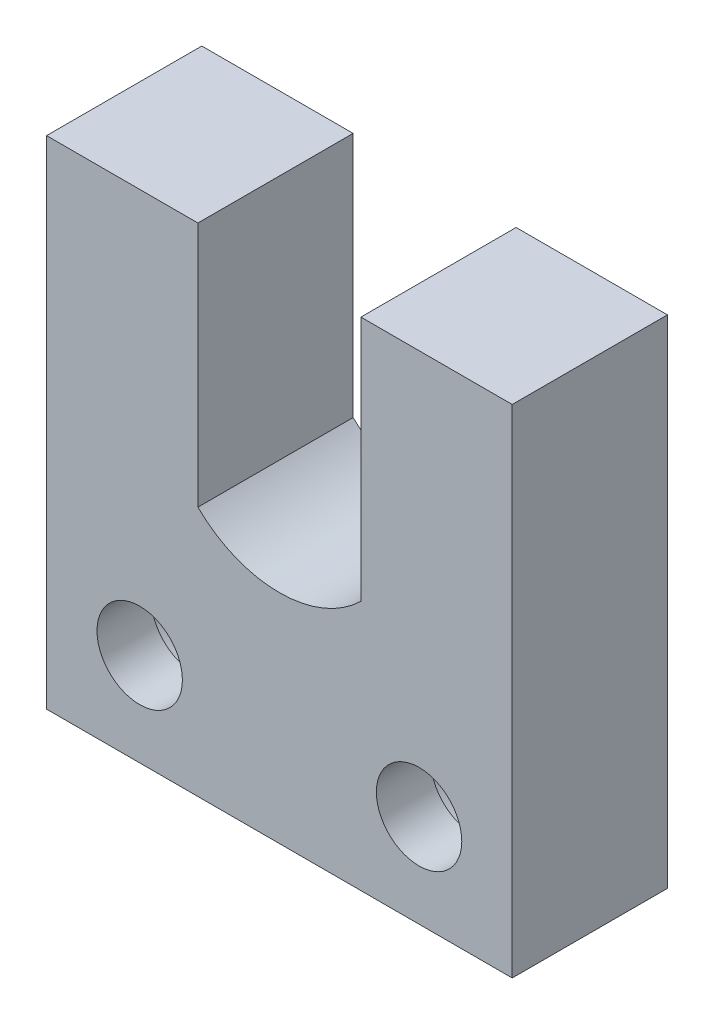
ISO-10303-21;
HEADER;
FILE_DESCRIPTION(('STEP AP214'),'2;1');
FILE_NAME('part.step','',(''),(''),'','','');
FILE_SCHEMA(('AUTOMOTIVE_DESIGN { 1 0 10303 214 1 1 1 1 }'));
ENDSEC;
DATA;
#1=APPLICATION_CONTEXT('core data for automotive mechanical design processes');
#2=APPLICATION_PROTOCOL_DEFINITION('international standard','automotive_design',2000,#1);
#3=PRODUCT_CONTEXT('',#1,'mechanical');
#4=PRODUCT('Part','Part','',(#3));
#5=PRODUCT_RELATED_PRODUCT_CATEGORY('part','',(#4));
#6=PRODUCT_DEFINITION_FORMATION('','',#4);
#7=PRODUCT_DEFINITION_CONTEXT('part definition',#1,'design');
#8=PRODUCT_DEFINITION('design','',#6,#7);
#9=PRODUCT_DEFINITION_SHAPE('','',#8);
#10=(LENGTH_UNIT() NAMED_UNIT(*) SI_UNIT(.MILLI.,.METRE.));
#11=(NAMED_UNIT(*) PLANE_ANGLE_UNIT() SI_UNIT($,.RADIAN.));
#12=(NAMED_UNIT(*) SI_UNIT($,.STERADIAN.) SOLID_ANGLE_UNIT());
#13=UNCERTAINTY_MEASURE_WITH_UNIT(LENGTH_MEASURE(1.E-05),#10,'distance_accuracy_value','');
#14=(GEOMETRIC_REPRESENTATION_CONTEXT(3) GLOBAL_UNCERTAINTY_ASSIGNED_CONTEXT((#13)) GLOBAL_UNIT_ASSIGNED_CONTEXT((#10,
#11,#12)) REPRESENTATION_CONTEXT('',''));
#15=CARTESIAN_POINT('',(0.,0.,0.));
#16=DIRECTION('',(0.,0.,1.));
#17=DIRECTION('',(1.,0.,0.));
#18=AXIS2_PLACEMENT_3D('',#15,#16,#17);
#19=CARTESIAN_POINT('',(6.,6.00000000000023,10.));
#20=DIRECTION('',(0.,0.,-1.));
#21=DIRECTION('',(-1.,0.,0.));
#22=AXIS2_PLACEMENT_3D('',#19,#20,#21);
#23=CYLINDRICAL_SURFACE('',#22,2.75);
#24=CARTESIAN_POINT('',(6.,6.00000000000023,10.));
#25=DIRECTION('',(0.,0.,1.));
#26=DIRECTION('',(1.,0.,0.));
#27=AXIS2_PLACEMENT_3D('',#24,#25,#26);
#28=CIRCLE('',#27,2.75);
#29=CARTESIAN_POINT('',(8.75,6.00000000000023,10.));
#30=VERTEX_POINT('',#29);
#31=EDGE_CURVE('E160',#30,#30,#28,.T.);
#32=ORIENTED_EDGE('',*,*,#31,.T.);
#33=EDGE_LOOP('',(#32));
#34=FACE_BOUND('',#33,.T.);
#35=CARTESIAN_POINT('',(6.,6.00000000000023,6.5));
#36=DIRECTION('',(0.,0.,-1.));
#37=DIRECTION('',(-1.,0.,0.));
#38=AXIS2_PLACEMENT_3D('',#35,#36,#37);
#39=CIRCLE('',#38,2.75);
#40=CARTESIAN_POINT('',(3.25,6.00000000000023,6.5));
#41=VERTEX_POINT('',#40);
#42=EDGE_CURVE('E36',#41,#41,#39,.T.);
#43=ORIENTED_EDGE('',*,*,#42,.T.);
#44=EDGE_LOOP('',(#43));
#45=FACE_BOUND('',#44,.T.);
#46=ADVANCED_FACE('F32',(#34,#45),#23,.F.);
#47=CARTESIAN_POINT('',(24.,6.00000000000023,10.));
#48=DIRECTION('',(0.,0.,-1.));
#49=DIRECTION('',(-1.,0.,0.));
#50=AXIS2_PLACEMENT_3D('',#47,#48,#49);
#51=CYLINDRICAL_SURFACE('',#50,2.75);
#52=CARTESIAN_POINT('',(24.,6.00000000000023,10.));
#53=DIRECTION('',(0.,0.,1.));
#54=DIRECTION('',(1.,0.,0.));
#55=AXIS2_PLACEMENT_3D('',#52,#53,#54);
#56=CIRCLE('',#55,2.75);
#57=CARTESIAN_POINT('',(26.75,6.00000000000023,10.));
#58=VERTEX_POINT('',#57);
#59=EDGE_CURVE('E136',#58,#58,#56,.T.);
#60=ORIENTED_EDGE('',*,*,#59,.T.);
#61=EDGE_LOOP('',(#60));
#62=FACE_BOUND('',#61,.T.);
#63=CARTESIAN_POINT('',(24.,6.00000000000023,6.5));
#64=DIRECTION('',(0.,0.,-1.));
#65=DIRECTION('',(-1.,0.,0.));
#66=AXIS2_PLACEMENT_3D('',#63,#64,#65);
#67=CIRCLE('',#66,2.75);
#68=CARTESIAN_POINT('',(21.25,6.00000000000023,6.5));
#69=VERTEX_POINT('',#68);
#70=EDGE_CURVE('E158',#69,#69,#67,.T.);
#71=ORIENTED_EDGE('',*,*,#70,.T.);
#72=EDGE_LOOP('',(#71));
#73=FACE_BOUND('',#72,.T.);
#74=ADVANCED_FACE('F215',(#62,#73),#51,.F.);
#75=CARTESIAN_POINT('',(15.,21.5,10.));
#76=DIRECTION('',(0.,0.,1.));
#77=DIRECTION('',(1.,0.,0.));
#78=AXIS2_PLACEMENT_3D('',#75,#76,#77);
#79=PLANE('',#78);
#80=ORIENTED_EDGE('',*,*,#59,.F.);
#81=EDGE_LOOP('',(#80));
#82=FACE_BOUND('',#81,.T.);
#83=DIRECTION('',(1.,0.,0.));
#84=VECTOR('',#83,1.);
#85=CARTESIAN_POINT('',(0.,0.,10.));
#86=LINE('',#85,#84);
#87=CARTESIAN_POINT('',(0.,0.,10.));
#88=VERTEX_POINT('',#87);
#89=CARTESIAN_POINT('',(30.,0.,10.));
#90=VERTEX_POINT('',#89);
#91=EDGE_CURVE('E147',#88,#90,#86,.T.);
#92=ORIENTED_EDGE('',*,*,#91,.T.);
#93=DIRECTION('',(0.,1.,0.));
#94=VECTOR('',#93,1.);
#95=CARTESIAN_POINT('',(30.,0.,10.));
#96=LINE('',#95,#94);
#97=CARTESIAN_POINT('',(30.,32.,10.));
#98=VERTEX_POINT('',#97);
#99=EDGE_CURVE('E94',#90,#98,#96,.T.);
#100=ORIENTED_EDGE('',*,*,#99,.T.);
#101=DIRECTION('',(-1.,0.,0.));
#102=VECTOR('',#101,1.);
#103=CARTESIAN_POINT('',(20.25,32.,10.));
#104=LINE('',#103,#102);
#105=CARTESIAN_POINT('',(20.25,32.,10.));
#106=VERTEX_POINT('',#105);
#107=EDGE_CURVE('E181',#98,#106,#104,.T.);
#108=ORIENTED_EDGE('',*,*,#107,.T.);
#109=DIRECTION('',(0.,-1.,0.));
#110=VECTOR('',#109,1.);
#111=CARTESIAN_POINT('',(20.25,16.1439286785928,10.));
#112=LINE('',#111,#110);
#113=CARTESIAN_POINT('',(20.25,16.1439286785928,10.));
#114=VERTEX_POINT('',#113);
#115=EDGE_CURVE('E183',#106,#114,#112,.T.);
#116=ORIENTED_EDGE('',*,*,#115,.T.);
#117=CARTESIAN_POINT('',(15.,21.5,10.));
#118=DIRECTION('',(0.,0.,-1.));
#119=DIRECTION('',(1.,0.,0.));
#120=AXIS2_PLACEMENT_3D('',#117,#118,#119);
#121=CIRCLE('',#120,7.50000000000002);
#122=CARTESIAN_POINT('',(9.75,16.1439286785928,10.));
#123=VERTEX_POINT('',#122);
#124=EDGE_CURVE('E114',#114,#123,#121,.T.);
#125=ORIENTED_EDGE('',*,*,#124,.T.);
#126=DIRECTION('',(0.,1.,0.));
#127=VECTOR('',#126,1.);
#128=CARTESIAN_POINT('',(9.75,16.1439286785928,10.));
#129=LINE('',#128,#127);
#130=CARTESIAN_POINT('',(9.75,31.9999999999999,10.));
#131=VERTEX_POINT('',#130);
#132=EDGE_CURVE('E107',#123,#131,#129,.T.);
#133=ORIENTED_EDGE('',*,*,#132,.T.);
#134=DIRECTION('',(-1.,0.,0.));
#135=VECTOR('',#134,1.);
#136=CARTESIAN_POINT('',(0.,32.,10.));
#137=LINE('',#136,#135);
#138=CARTESIAN_POINT('',(0.,32.,10.));
#139=VERTEX_POINT('',#138);
#140=EDGE_CURVE('E112',#131,#139,#137,.T.);
#141=ORIENTED_EDGE('',*,*,#140,.T.);
#142=DIRECTION('',(0.,-1.,0.));
#143=VECTOR('',#142,1.);
#144=CARTESIAN_POINT('',(0.,0.,10.));
#145=LINE('',#144,#143);
#146=EDGE_CURVE('E51',#139,#88,#145,.T.);
#147=ORIENTED_EDGE('',*,*,#146,.T.);
#148=EDGE_LOOP('',(#92,#100,#108,#116,#125,#133,#141,#147));
#149=FACE_BOUND('',#148,.T.);
#150=ORIENTED_EDGE('',*,*,#31,.F.);
#151=EDGE_LOOP('',(#150));
#152=FACE_BOUND('',#151,.T.);
#153=ADVANCED_FACE('F109',(#82,#149,#152),#79,.T.);
#154=CARTESIAN_POINT('',(15.,21.5,0.));
#155=DIRECTION('',(0.,0.,1.));
#156=DIRECTION('',(1.,0.,0.));
#157=AXIS2_PLACEMENT_3D('',#154,#155,#156);
#158=PLANE('',#157);
#159=CARTESIAN_POINT('',(6.,6.00000000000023,0.));
#160=DIRECTION('',(0.,0.,-1.));
#161=DIRECTION('',(-1.,0.,0.));
#162=AXIS2_PLACEMENT_3D('',#159,#160,#161);
#163=CIRCLE('',#162,4.75);
#164=CARTESIAN_POINT('',(1.25,6.00000000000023,0.));
#165=VERTEX_POINT('',#164);
#166=EDGE_CURVE('E174',#165,#165,#163,.T.);
#167=ORIENTED_EDGE('',*,*,#166,.F.);
#168=EDGE_LOOP('',(#167));
#169=FACE_BOUND('',#168,.T.);
#170=CARTESIAN_POINT('',(24.,6.00000000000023,0.));
#171=DIRECTION('',(0.,0.,-1.));
#172=DIRECTION('',(-1.,0.,0.));
#173=AXIS2_PLACEMENT_3D('',#170,#171,#172);
#174=CIRCLE('',#173,4.75);
#175=CARTESIAN_POINT('',(19.25,6.00000000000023,0.));
#176=VERTEX_POINT('',#175);
#177=EDGE_CURVE('E167',#176,#176,#174,.T.);
#178=ORIENTED_EDGE('',*,*,#177,.F.);
#179=EDGE_LOOP('',(#178));
#180=FACE_BOUND('',#179,.T.);
#181=DIRECTION('',(1.,0.,0.));
#182=VECTOR('',#181,1.);
#183=CARTESIAN_POINT('',(0.,0.,0.));
#184=LINE('',#183,#182);
#185=CARTESIAN_POINT('',(0.,0.,0.));
#186=VERTEX_POINT('',#185);
#187=CARTESIAN_POINT('',(30.,0.,0.));
#188=VERTEX_POINT('',#187);
#189=EDGE_CURVE('E132',#186,#188,#184,.T.);
#190=ORIENTED_EDGE('',*,*,#189,.F.);
#191=DIRECTION('',(0.,-1.,0.));
#192=VECTOR('',#191,1.);
#193=CARTESIAN_POINT('',(0.,0.,0.));
#194=LINE('',#193,#192);
#195=CARTESIAN_POINT('',(0.,32.,0.));
#196=VERTEX_POINT('',#195);
#197=EDGE_CURVE('E86',#196,#186,#194,.T.);
#198=ORIENTED_EDGE('',*,*,#197,.F.);
#199=DIRECTION('',(-1.,0.,0.));
#200=VECTOR('',#199,1.);
#201=CARTESIAN_POINT('',(0.,32.,0.));
#202=LINE('',#201,#200);
#203=CARTESIAN_POINT('',(9.75,31.9999999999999,0.));
#204=VERTEX_POINT('',#203);
#205=EDGE_CURVE('E80',#204,#196,#202,.T.);
#206=ORIENTED_EDGE('',*,*,#205,.F.);
#207=DIRECTION('',(0.,1.,0.));
#208=VECTOR('',#207,1.);
#209=CARTESIAN_POINT('',(9.75,16.1439286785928,0.));
#210=LINE('',#209,#208);
#211=CARTESIAN_POINT('',(9.75,16.1439286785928,0.));
#212=VERTEX_POINT('',#211);
#213=EDGE_CURVE('E122',#212,#204,#210,.T.);
#214=ORIENTED_EDGE('',*,*,#213,.F.);
#215=CARTESIAN_POINT('',(15.,21.5,0.));
#216=DIRECTION('',(0.,0.,-1.));
#217=DIRECTION('',(1.,0.,0.));
#218=AXIS2_PLACEMENT_3D('',#215,#216,#217);
#219=CIRCLE('',#218,7.50000000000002);
#220=CARTESIAN_POINT('',(20.25,16.1439286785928,0.));
#221=VERTEX_POINT('',#220);
#222=EDGE_CURVE('E142',#221,#212,#219,.T.);
#223=ORIENTED_EDGE('',*,*,#222,.F.);
#224=DIRECTION('',(0.,-1.,0.));
#225=VECTOR('',#224,1.);
#226=CARTESIAN_POINT('',(20.25,16.1439286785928,0.));
#227=LINE('',#226,#225);
#228=CARTESIAN_POINT('',(20.25,32.,0.));
#229=VERTEX_POINT('',#228);
#230=EDGE_CURVE('E140',#229,#221,#227,.T.);
#231=ORIENTED_EDGE('',*,*,#230,.F.);
#232=DIRECTION('',(-1.,0.,0.));
#233=VECTOR('',#232,1.);
#234=CARTESIAN_POINT('',(20.25,32.,0.));
#235=LINE('',#234,#233);
#236=CARTESIAN_POINT('',(30.,32.,0.));
#237=VERTEX_POINT('',#236);
#238=EDGE_CURVE('E138',#237,#229,#235,.T.);
#239=ORIENTED_EDGE('',*,*,#238,.F.);
#240=DIRECTION('',(0.,1.,0.));
#241=VECTOR('',#240,1.);
#242=CARTESIAN_POINT('',(30.,0.,0.));
#243=LINE('',#242,#241);
#244=EDGE_CURVE('E135',#188,#237,#243,.T.);
#245=ORIENTED_EDGE('',*,*,#244,.F.);
#246=EDGE_LOOP('',(#190,#198,#206,#214,#223,#231,#239,#245));
#247=FACE_BOUND('',#246,.T.);
#248=ADVANCED_FACE('F196',(#169,#180,#247),#158,.F.);
#249=CARTESIAN_POINT('',(0.,0.,10.));
#250=DIRECTION('',(0.,1.,0.));
#251=DIRECTION('',(0.,0.,1.));
#252=AXIS2_PLACEMENT_3D('',#249,#250,#251);
#253=PLANE('',#252);
#254=ORIENTED_EDGE('',*,*,#189,.T.);
#255=DIRECTION('',(0.,0.,-1.));
#256=VECTOR('',#255,1.);
#257=CARTESIAN_POINT('',(30.,0.,10.));
#258=LINE('',#257,#256);
#259=EDGE_CURVE('E11',#90,#188,#258,.T.);
#260=ORIENTED_EDGE('',*,*,#259,.F.);
#261=ORIENTED_EDGE('',*,*,#91,.F.);
#262=DIRECTION('',(0.,0.,-1.));
#263=VECTOR('',#262,1.);
#264=CARTESIAN_POINT('',(0.,0.,10.));
#265=LINE('',#264,#263);
#266=EDGE_CURVE('E128',#88,#186,#265,.T.);
#267=ORIENTED_EDGE('',*,*,#266,.T.);
#268=EDGE_LOOP('',(#254,#260,#261,#267));
#269=FACE_BOUND('',#268,.T.);
#270=ADVANCED_FACE('F34',(#269),#253,.F.);
#271=CARTESIAN_POINT('',(30.,0.,10.));
#272=DIRECTION('',(-1.,0.,0.));
#273=DIRECTION('',(0.,0.,1.));
#274=AXIS2_PLACEMENT_3D('',#271,#272,#273);
#275=PLANE('',#274);
#276=ORIENTED_EDGE('',*,*,#244,.T.);
#277=DIRECTION('',(0.,0.,-1.));
#278=VECTOR('',#277,1.);
#279=CARTESIAN_POINT('',(30.,32.,10.));
#280=LINE('',#279,#278);
#281=EDGE_CURVE('E42',#98,#237,#280,.T.);
#282=ORIENTED_EDGE('',*,*,#281,.F.);
#283=ORIENTED_EDGE('',*,*,#99,.F.);
#284=ORIENTED_EDGE('',*,*,#259,.T.);
#285=EDGE_LOOP('',(#276,#282,#283,#284));
#286=FACE_BOUND('',#285,.T.);
#287=ADVANCED_FACE('F233',(#286),#275,.F.);
#288=CARTESIAN_POINT('',(20.25,32.,10.));
#289=DIRECTION('',(0.,-1.,0.));
#290=DIRECTION('',(0.,0.,-1.));
#291=AXIS2_PLACEMENT_3D('',#288,#289,#290);
#292=PLANE('',#291);
#293=ORIENTED_EDGE('',*,*,#238,.T.);
#294=DIRECTION('',(0.,0.,-1.));
#295=VECTOR('',#294,1.);
#296=CARTESIAN_POINT('',(20.25,32.,10.));
#297=LINE('',#296,#295);
#298=EDGE_CURVE('E154',#106,#229,#297,.T.);
#299=ORIENTED_EDGE('',*,*,#298,.F.);
#300=ORIENTED_EDGE('',*,*,#107,.F.);
#301=ORIENTED_EDGE('',*,*,#281,.T.);
#302=EDGE_LOOP('',(#293,#299,#300,#301));
#303=FACE_BOUND('',#302,.T.);
#304=ADVANCED_FACE('F318',(#303),#292,.F.);
#305=CARTESIAN_POINT('',(20.25,16.1439286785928,10.));
#306=DIRECTION('',(1.,0.,0.));
#307=DIRECTION('',(0.,0.,-1.));
#308=AXIS2_PLACEMENT_3D('',#305,#306,#307);
#309=PLANE('',#308);
#310=ORIENTED_EDGE('',*,*,#230,.T.);
#311=DIRECTION('',(0.,0.,-1.));
#312=VECTOR('',#311,1.);
#313=CARTESIAN_POINT('',(20.25,16.1439286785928,10.));
#314=LINE('',#313,#312);
#315=EDGE_CURVE('E151',#114,#221,#314,.T.);
#316=ORIENTED_EDGE('',*,*,#315,.F.);
#317=ORIENTED_EDGE('',*,*,#115,.F.);
#318=ORIENTED_EDGE('',*,*,#298,.T.);
#319=EDGE_LOOP('',(#310,#316,#317,#318));
#320=FACE_BOUND('',#319,.T.);
#321=ADVANCED_FACE('F189',(#320),#309,.F.);
#322=CARTESIAN_POINT('',(15.,21.5,10.));
#323=DIRECTION('',(0.,0.,-1.));
#324=DIRECTION('',(-1.,0.,0.));
#325=AXIS2_PLACEMENT_3D('',#322,#323,#324);
#326=CYLINDRICAL_SURFACE('',#325,7.50000000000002);
#327=ORIENTED_EDGE('',*,*,#222,.T.);
#328=DIRECTION('',(0.,0.,-1.));
#329=VECTOR('',#328,1.);
#330=CARTESIAN_POINT('',(9.75,16.1439286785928,10.));
#331=LINE('',#330,#329);
#332=EDGE_CURVE('E123',#123,#212,#331,.T.);
#333=ORIENTED_EDGE('',*,*,#332,.F.);
#334=ORIENTED_EDGE('',*,*,#124,.F.);
#335=ORIENTED_EDGE('',*,*,#315,.T.);
#336=EDGE_LOOP('',(#327,#333,#334,#335));
#337=FACE_BOUND('',#336,.T.);
#338=ADVANCED_FACE('F193',(#337),#326,.F.);
#339=CARTESIAN_POINT('',(9.75,16.1439286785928,10.));
#340=DIRECTION('',(-1.,0.,0.));
#341=DIRECTION('',(0.,0.,1.));
#342=AXIS2_PLACEMENT_3D('',#339,#340,#341);
#343=PLANE('',#342);
#344=ORIENTED_EDGE('',*,*,#213,.T.);
#345=DIRECTION('',(0.,0.,-1.));
#346=VECTOR('',#345,1.);
#347=CARTESIAN_POINT('',(9.75,31.9999999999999,10.));
#348=LINE('',#347,#346);
#349=EDGE_CURVE('E119',#131,#204,#348,.T.);
#350=ORIENTED_EDGE('',*,*,#349,.F.);
#351=ORIENTED_EDGE('',*,*,#132,.F.);
#352=ORIENTED_EDGE('',*,*,#332,.T.);
#353=EDGE_LOOP('',(#344,#350,#351,#352));
#354=FACE_BOUND('',#353,.T.);
#355=ADVANCED_FACE('F120',(#354),#343,.F.);
#356=CARTESIAN_POINT('',(0.,32.,10.));
#357=DIRECTION('',(0.,-1.,0.));
#358=DIRECTION('',(1.,0.,0.));
#359=AXIS2_PLACEMENT_3D('',#356,#357,#358);
#360=PLANE('',#359);
#361=ORIENTED_EDGE('',*,*,#205,.T.);
#362=DIRECTION('',(0.,0.,-1.));
#363=VECTOR('',#362,1.);
#364=CARTESIAN_POINT('',(0.,32.,10.));
#365=LINE('',#364,#363);
#366=EDGE_CURVE('E124',#139,#196,#365,.T.);
#367=ORIENTED_EDGE('',*,*,#366,.F.);
#368=ORIENTED_EDGE('',*,*,#140,.F.);
#369=ORIENTED_EDGE('',*,*,#349,.T.);
#370=EDGE_LOOP('',(#361,#367,#368,#369));
#371=FACE_BOUND('',#370,.T.);
#372=ADVANCED_FACE('F126',(#371),#360,.F.);
#373=CARTESIAN_POINT('',(0.,0.,10.));
#374=DIRECTION('',(1.,0.,0.));
#375=DIRECTION('',(0.,0.,-1.));
#376=AXIS2_PLACEMENT_3D('',#373,#374,#375);
#377=PLANE('',#376);
#378=ORIENTED_EDGE('',*,*,#197,.T.);
#379=ORIENTED_EDGE('',*,*,#266,.F.);
#380=ORIENTED_EDGE('',*,*,#146,.F.);
#381=ORIENTED_EDGE('',*,*,#366,.T.);
#382=EDGE_LOOP('',(#378,#379,#380,#381));
#383=FACE_BOUND('',#382,.T.);
#384=ADVANCED_FACE('F201',(#383),#377,.F.);
#385=CARTESIAN_POINT('',(24.,6.00000000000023,6.5));
#386=DIRECTION('',(0.,0.,-1.));
#387=DIRECTION('',(-1.,0.,0.));
#388=AXIS2_PLACEMENT_3D('',#385,#386,#387);
#389=CYLINDRICAL_SURFACE('',#388,4.75);
#390=CARTESIAN_POINT('',(24.,6.00000000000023,6.5));
#391=DIRECTION('',(0.,0.,-1.));
#392=DIRECTION('',(-1.,0.,0.));
#393=AXIS2_PLACEMENT_3D('',#390,#391,#392);
#394=CIRCLE('',#393,4.75);
#395=CARTESIAN_POINT('',(19.25,6.00000000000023,6.5));
#396=VERTEX_POINT('',#395);
#397=EDGE_CURVE('E161',#396,#396,#394,.T.);
#398=CARTESIAN_POINT('',(19.25,6.00000000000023,6.5));
#399=CARTESIAN_POINT('',(19.25,6.00000000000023,6.43229166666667));
#400=CARTESIAN_POINT('',(19.25,6.00000000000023,6.36458333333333));
#401=CARTESIAN_POINT('',(19.25,6.00000000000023,6.22916666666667));
#402=CARTESIAN_POINT('',(19.25,6.00000000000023,6.16145833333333));
#403=CARTESIAN_POINT('',(19.25,6.00000000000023,6.02604166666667));
#404=CARTESIAN_POINT('',(19.25,6.00000000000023,5.95833333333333));
#405=CARTESIAN_POINT('',(19.25,6.00000000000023,5.82291666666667));
#406=CARTESIAN_POINT('',(19.25,6.00000000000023,5.75520833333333));
#407=CARTESIAN_POINT('',(19.25,6.00000000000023,5.61979166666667));
#408=CARTESIAN_POINT('',(19.25,6.00000000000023,5.55208333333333));
#409=CARTESIAN_POINT('',(19.25,6.00000000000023,5.41666666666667));
#410=CARTESIAN_POINT('',(19.25,6.00000000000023,5.34895833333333));
#411=CARTESIAN_POINT('',(19.25,6.00000000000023,5.21354166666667));
#412=CARTESIAN_POINT('',(19.25,6.00000000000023,5.14583333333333));
#413=CARTESIAN_POINT('',(19.25,6.00000000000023,5.01041666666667));
#414=CARTESIAN_POINT('',(19.25,6.00000000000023,4.94270833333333));
#415=CARTESIAN_POINT('',(19.25,6.00000000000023,4.80729166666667));
#416=CARTESIAN_POINT('',(19.25,6.00000000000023,4.73958333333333));
#417=CARTESIAN_POINT('',(19.25,6.00000000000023,4.60416666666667));
#418=CARTESIAN_POINT('',(19.25,6.00000000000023,4.53645833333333));
#419=CARTESIAN_POINT('',(19.25,6.00000000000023,4.40104166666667));
#420=CARTESIAN_POINT('',(19.25,6.00000000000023,4.33333333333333));
#421=CARTESIAN_POINT('',(19.25,6.00000000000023,4.19791666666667));
#422=CARTESIAN_POINT('',(19.25,6.00000000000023,4.13020833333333));
#423=CARTESIAN_POINT('',(19.25,6.00000000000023,3.99479166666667));
#424=CARTESIAN_POINT('',(19.25,6.00000000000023,3.92708333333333));
#425=CARTESIAN_POINT('',(19.25,6.00000000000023,3.79166666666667));
#426=CARTESIAN_POINT('',(19.25,6.00000000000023,3.72395833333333));
#427=CARTESIAN_POINT('',(19.25,6.00000000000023,3.58854166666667));
#428=CARTESIAN_POINT('',(19.25,6.00000000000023,3.52083333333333));
#429=CARTESIAN_POINT('',(19.25,6.00000000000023,3.38541666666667));
#430=CARTESIAN_POINT('',(19.25,6.00000000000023,3.31770833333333));
#431=CARTESIAN_POINT('',(19.25,6.00000000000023,3.18229166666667));
#432=CARTESIAN_POINT('',(19.25,6.00000000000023,3.11458333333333));
#433=CARTESIAN_POINT('',(19.25,6.00000000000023,2.97916666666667));
#434=CARTESIAN_POINT('',(19.25,6.00000000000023,2.91145833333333));
#435=CARTESIAN_POINT('',(19.25,6.00000000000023,2.77604166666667));
#436=CARTESIAN_POINT('',(19.25,6.00000000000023,2.70833333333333));
#437=CARTESIAN_POINT('',(19.25,6.00000000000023,2.57291666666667));
#438=CARTESIAN_POINT('',(19.25,6.00000000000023,2.50520833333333));
#439=CARTESIAN_POINT('',(19.25,6.00000000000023,2.36979166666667));
#440=CARTESIAN_POINT('',(19.25,6.00000000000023,2.30208333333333));
#441=CARTESIAN_POINT('',(19.25,6.00000000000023,2.16666666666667));
#442=CARTESIAN_POINT('',(19.25,6.00000000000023,2.09895833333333));
#443=CARTESIAN_POINT('',(19.25,6.00000000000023,1.96354166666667));
#444=CARTESIAN_POINT('',(19.25,6.00000000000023,1.89583333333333));
#445=CARTESIAN_POINT('',(19.25,6.00000000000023,1.76041666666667));
#446=CARTESIAN_POINT('',(19.25,6.00000000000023,1.69270833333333));
#447=CARTESIAN_POINT('',(19.25,6.00000000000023,1.55729166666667));
#448=CARTESIAN_POINT('',(19.25,6.00000000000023,1.48958333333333));
#449=CARTESIAN_POINT('',(19.25,6.00000000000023,1.35416666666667));
#450=CARTESIAN_POINT('',(19.25,6.00000000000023,1.28645833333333));
#451=CARTESIAN_POINT('',(19.25,6.00000000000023,1.15104166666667));
#452=CARTESIAN_POINT('',(19.25,6.00000000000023,1.08333333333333));
#453=CARTESIAN_POINT('',(19.25,6.00000000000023,0.947916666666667));
#454=CARTESIAN_POINT('',(19.25,6.00000000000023,0.880208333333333));
#455=CARTESIAN_POINT('',(19.25,6.00000000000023,0.744791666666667));
#456=CARTESIAN_POINT('',(19.25,6.00000000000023,0.677083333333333));
#457=CARTESIAN_POINT('',(19.25,6.00000000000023,0.541666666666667));
#458=CARTESIAN_POINT('',(19.25,6.00000000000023,0.473958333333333));
#459=CARTESIAN_POINT('',(19.25,6.00000000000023,0.338541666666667));
#460=CARTESIAN_POINT('',(19.25,6.00000000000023,0.270833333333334));
#461=CARTESIAN_POINT('',(19.25,6.00000000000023,0.135416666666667));
#462=CARTESIAN_POINT('',(19.25,6.00000000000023,0.0677083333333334));
#463=CARTESIAN_POINT('',(19.25,6.00000000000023,0.));
#464=B_SPLINE_CURVE_WITH_KNOTS('',3,(#398,#399,#400,#401,#402,#403,#404,#405,#406,#407,#408,
#409,#410,#411,#412,#413,#414,#415,#416,#417,#418,#419,#420,#421,#422,#423,#424,#425,#426,#427,
#428,#429,#430,#431,#432,#433,#434,#435,#436,#437,#438,#439,#440,#441,#442,#443,#444,#445,#446,
#447,#448,#449,#450,#451,#452,#453,#454,#455,#456,#457,#458,#459,#460,#461,#462,#463),
.UNSPECIFIED.,.F.,.F.,(4,2,2,2,2,2,2,2,2,2,2,2,2,2,2,2,2,2,2,2,2,2,2,2,2,2,2,2,2,2,2,2,4),(0.,
0.203124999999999,0.40625,0.609375,0.8125,1.015625,1.21875,1.421875,1.625,1.828125,2.03125,
2.234375,2.4375,2.640625,2.84375,3.046875,3.25,3.453125,3.65625,3.859375,4.0625,4.265625,
4.46875,4.671875,4.875,5.078125,5.28125,5.484375,5.6875,5.890625,6.09375,6.296875,6.5),.UNSPECIFIED.);
#465=EDGE_CURVE('BSEAM203',#396,#176,#464,.T.);
#466=ORIENTED_EDGE('',*,*,#397,.F.);
#467=ORIENTED_EDGE('',*,*,#177,.T.);
#468=ORIENTED_EDGE('',*,*,#465,.T.);
#469=ORIENTED_EDGE('',*,*,#465,.F.);
#470=EDGE_LOOP('',(#466,#468,#467,#469));
#471=FACE_BOUND('',#470,.T.);
#472=ADVANCED_FACE('F203',(#471),#389,.F.);
#473=CARTESIAN_POINT('',(24.,6.00000000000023,6.5));
#474=DIRECTION('',(0.,0.,-1.));
#475=DIRECTION('',(-1.,0.,0.));
#476=AXIS2_PLACEMENT_3D('',#473,#474,#475);
#477=PLANE('',#476);
#478=ORIENTED_EDGE('',*,*,#70,.F.);
#479=EDGE_LOOP('',(#478));
#480=FACE_BOUND('',#479,.T.);
#481=ORIENTED_EDGE('',*,*,#397,.T.);
#482=EDGE_LOOP('',(#481));
#483=FACE_BOUND('',#482,.T.);
#484=ADVANCED_FACE('F209',(#480,#483),#477,.T.);
#485=CARTESIAN_POINT('',(6.,6.00000000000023,6.5));
#486=DIRECTION('',(0.,0.,-1.));
#487=DIRECTION('',(-1.,0.,0.));
#488=AXIS2_PLACEMENT_3D('',#485,#486,#487);
#489=CYLINDRICAL_SURFACE('',#488,4.75);
#490=CARTESIAN_POINT('',(6.,6.00000000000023,6.5));
#491=DIRECTION('',(0.,0.,-1.));
#492=DIRECTION('',(-1.,0.,0.));
#493=AXIS2_PLACEMENT_3D('',#490,#491,#492);
#494=CIRCLE('',#493,4.75);
#495=CARTESIAN_POINT('',(1.25,6.00000000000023,6.5));
#496=VERTEX_POINT('',#495);
#497=EDGE_CURVE('E240',#496,#496,#494,.T.);
#498=CARTESIAN_POINT('',(1.25,6.00000000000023,6.5));
#499=CARTESIAN_POINT('',(1.25,6.00000000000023,6.43229166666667));
#500=CARTESIAN_POINT('',(1.25,6.00000000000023,6.36458333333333));
#501=CARTESIAN_POINT('',(1.25,6.00000000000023,6.22916666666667));
#502=CARTESIAN_POINT('',(1.25,6.00000000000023,6.16145833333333));
#503=CARTESIAN_POINT('',(1.25,6.00000000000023,6.02604166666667));
#504=CARTESIAN_POINT('',(1.25,6.00000000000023,5.95833333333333));
#505=CARTESIAN_POINT('',(1.25,6.00000000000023,5.82291666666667));
#506=CARTESIAN_POINT('',(1.25,6.00000000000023,5.75520833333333));
#507=CARTESIAN_POINT('',(1.25,6.00000000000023,5.61979166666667));
#508=CARTESIAN_POINT('',(1.25,6.00000000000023,5.55208333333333));
#509=CARTESIAN_POINT('',(1.25,6.00000000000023,5.41666666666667));
#510=CARTESIAN_POINT('',(1.25,6.00000000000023,5.34895833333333));
#511=CARTESIAN_POINT('',(1.25,6.00000000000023,5.21354166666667));
#512=CARTESIAN_POINT('',(1.25,6.00000000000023,5.14583333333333));
#513=CARTESIAN_POINT('',(1.25,6.00000000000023,5.01041666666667));
#514=CARTESIAN_POINT('',(1.25,6.00000000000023,4.94270833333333));
#515=CARTESIAN_POINT('',(1.25,6.00000000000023,4.80729166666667));
#516=CARTESIAN_POINT('',(1.25,6.00000000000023,4.73958333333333));
#517=CARTESIAN_POINT('',(1.25,6.00000000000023,4.60416666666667));
#518=CARTESIAN_POINT('',(1.25,6.00000000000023,4.53645833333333));
#519=CARTESIAN_POINT('',(1.25,6.00000000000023,4.40104166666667));
#520=CARTESIAN_POINT('',(1.25,6.00000000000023,4.33333333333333));
#521=CARTESIAN_POINT('',(1.25,6.00000000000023,4.19791666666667));
#522=CARTESIAN_POINT('',(1.25,6.00000000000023,4.13020833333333));
#523=CARTESIAN_POINT('',(1.25,6.00000000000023,3.99479166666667));
#524=CARTESIAN_POINT('',(1.25,6.00000000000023,3.92708333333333));
#525=CARTESIAN_POINT('',(1.25,6.00000000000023,3.79166666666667));
#526=CARTESIAN_POINT('',(1.25,6.00000000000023,3.72395833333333));
#527=CARTESIAN_POINT('',(1.25,6.00000000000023,3.58854166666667));
#528=CARTESIAN_POINT('',(1.25,6.00000000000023,3.52083333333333));
#529=CARTESIAN_POINT('',(1.25,6.00000000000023,3.38541666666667));
#530=CARTESIAN_POINT('',(1.25,6.00000000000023,3.31770833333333));
#531=CARTESIAN_POINT('',(1.25,6.00000000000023,3.18229166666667));
#532=CARTESIAN_POINT('',(1.25,6.00000000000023,3.11458333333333));
#533=CARTESIAN_POINT('',(1.25,6.00000000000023,2.97916666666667));
#534=CARTESIAN_POINT('',(1.25,6.00000000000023,2.91145833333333));
#535=CARTESIAN_POINT('',(1.25,6.00000000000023,2.77604166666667));
#536=CARTESIAN_POINT('',(1.25,6.00000000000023,2.70833333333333));
#537=CARTESIAN_POINT('',(1.25,6.00000000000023,2.57291666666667));
#538=CARTESIAN_POINT('',(1.25,6.00000000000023,2.50520833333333));
#539=CARTESIAN_POINT('',(1.25,6.00000000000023,2.36979166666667));
#540=CARTESIAN_POINT('',(1.25,6.00000000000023,2.30208333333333));
#541=CARTESIAN_POINT('',(1.25,6.00000000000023,2.16666666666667));
#542=CARTESIAN_POINT('',(1.25,6.00000000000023,2.09895833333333));
#543=CARTESIAN_POINT('',(1.25,6.00000000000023,1.96354166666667));
#544=CARTESIAN_POINT('',(1.25,6.00000000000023,1.89583333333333));
#545=CARTESIAN_POINT('',(1.25,6.00000000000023,1.76041666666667));
#546=CARTESIAN_POINT('',(1.25,6.00000000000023,1.69270833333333));
#547=CARTESIAN_POINT('',(1.25,6.00000000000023,1.55729166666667));
#548=CARTESIAN_POINT('',(1.25,6.00000000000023,1.48958333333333));
#549=CARTESIAN_POINT('',(1.25,6.00000000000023,1.35416666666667));
#550=CARTESIAN_POINT('',(1.25,6.00000000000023,1.28645833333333));
#551=CARTESIAN_POINT('',(1.25,6.00000000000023,1.15104166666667));
#552=CARTESIAN_POINT('',(1.25,6.00000000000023,1.08333333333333));
#553=CARTESIAN_POINT('',(1.25,6.00000000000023,0.947916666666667));
#554=CARTESIAN_POINT('',(1.25,6.00000000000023,0.880208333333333));
#555=CARTESIAN_POINT('',(1.25,6.00000000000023,0.744791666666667));
#556=CARTESIAN_POINT('',(1.25,6.00000000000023,0.677083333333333));
#557=CARTESIAN_POINT('',(1.25,6.00000000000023,0.541666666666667));
#558=CARTESIAN_POINT('',(1.25,6.00000000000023,0.473958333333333));
#559=CARTESIAN_POINT('',(1.25,6.00000000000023,0.338541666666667));
#560=CARTESIAN_POINT('',(1.25,6.00000000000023,0.270833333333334));
#561=CARTESIAN_POINT('',(1.25,6.00000000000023,0.135416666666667));
#562=CARTESIAN_POINT('',(1.25,6.00000000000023,0.0677083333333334));
#563=CARTESIAN_POINT('',(1.25,6.00000000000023,0.));
#564=B_SPLINE_CURVE_WITH_KNOTS('',3,(#498,#499,#500,#501,#502,#503,#504,#505,#506,#507,#508,
#509,#510,#511,#512,#513,#514,#515,#516,#517,#518,#519,#520,#521,#522,#523,#524,#525,#526,#527,
#528,#529,#530,#531,#532,#533,#534,#535,#536,#537,#538,#539,#540,#541,#542,#543,#544,#545,#546,
#547,#548,#549,#550,#551,#552,#553,#554,#555,#556,#557,#558,#559,#560,#561,#562,#563),
.UNSPECIFIED.,.F.,.F.,(4,2,2,2,2,2,2,2,2,2,2,2,2,2,2,2,2,2,2,2,2,2,2,2,2,2,2,2,2,2,2,2,4),(0.,
0.203124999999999,0.40625,0.609375,0.8125,1.015625,1.21875,1.421875,1.625,1.828125,2.03125,
2.234375,2.4375,2.640625,2.84375,3.046875,3.25,3.453125,3.65625,3.859375,4.0625,4.265625,
4.46875,4.671875,4.875,5.078125,5.28125,5.484375,5.6875,5.890625,6.09375,6.296875,6.5),.UNSPECIFIED.);
#565=EDGE_CURVE('BSEAM249',#496,#165,#564,.T.);
#566=ORIENTED_EDGE('',*,*,#497,.F.);
#567=ORIENTED_EDGE('',*,*,#166,.T.);
#568=ORIENTED_EDGE('',*,*,#565,.T.);
#569=ORIENTED_EDGE('',*,*,#565,.F.);
#570=EDGE_LOOP('',(#566,#568,#567,#569));
#571=FACE_BOUND('',#570,.T.);
#572=ADVANCED_FACE('F249',(#571),#489,.F.);
#573=CARTESIAN_POINT('',(6.,6.00000000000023,6.5));
#574=DIRECTION('',(0.,0.,-1.));
#575=DIRECTION('',(-1.,0.,0.));
#576=AXIS2_PLACEMENT_3D('',#573,#574,#575);
#577=PLANE('',#576);
#578=ORIENTED_EDGE('',*,*,#42,.F.);
#579=EDGE_LOOP('',(#578));
#580=FACE_BOUND('',#579,.T.);
#581=ORIENTED_EDGE('',*,*,#497,.T.);
#582=EDGE_LOOP('',(#581));
#583=FACE_BOUND('',#582,.T.);
#584=ADVANCED_FACE('F247',(#580,#583),#577,.T.);
#585=CLOSED_SHELL('',(#46,#74,#153,#248,#270,#287,#304,#321,#338,#355,#372,#384,#472,#484,#572,#584));
#586=MANIFOLD_SOLID_BREP('B2',#585);
#587=ADVANCED_BREP_SHAPE_REPRESENTATION('',(#18,#586),#14);
#588=SHAPE_DEFINITION_REPRESENTATION(#9,#587);
ENDSEC;
END-ISO-10303-21;
